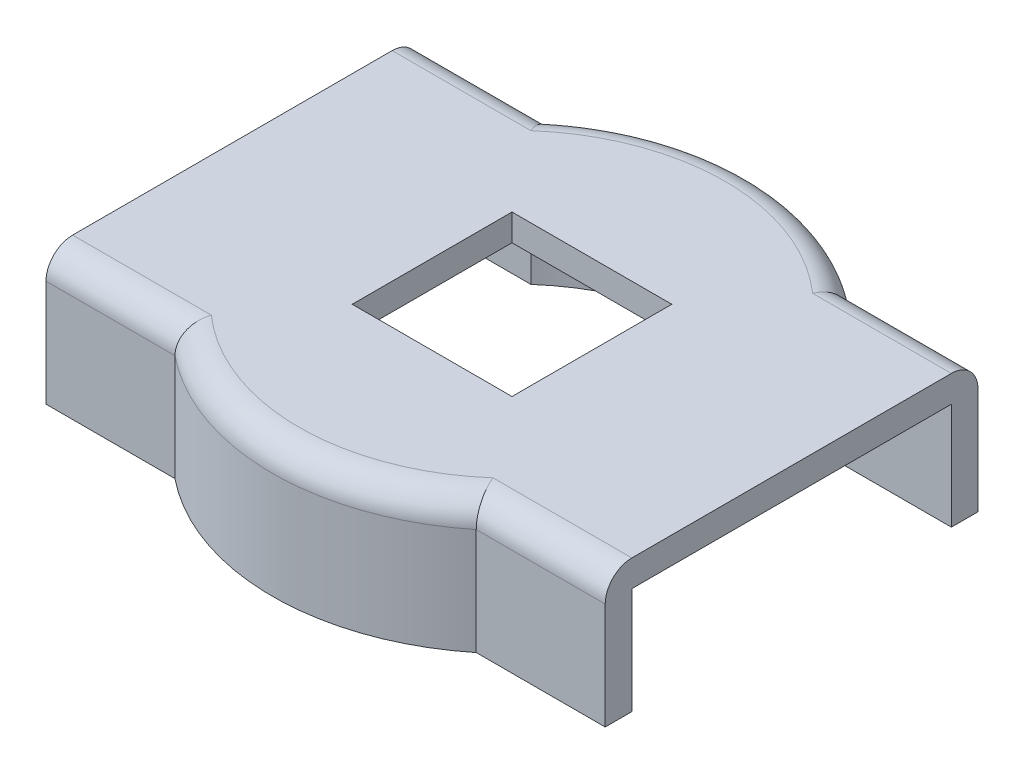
ISO-10303-21;
HEADER;
FILE_DESCRIPTION(('STEP AP214'),'2;1');
FILE_NAME('part.step','',(''),(''),'','','');
FILE_SCHEMA(('AUTOMOTIVE_DESIGN { 1 0 10303 214 1 1 1 1 }'));
ENDSEC;
DATA;
#1=APPLICATION_CONTEXT('core data for automotive mechanical design processes');
#2=APPLICATION_PROTOCOL_DEFINITION('international standard','automotive_design',2000,#1);
#3=PRODUCT_CONTEXT('',#1,'mechanical');
#4=PRODUCT('Part','Part','',(#3));
#5=PRODUCT_RELATED_PRODUCT_CATEGORY('part','',(#4));
#6=PRODUCT_DEFINITION_FORMATION('','',#4);
#7=PRODUCT_DEFINITION_CONTEXT('part definition',#1,'design');
#8=PRODUCT_DEFINITION('design','',#6,#7);
#9=PRODUCT_DEFINITION_SHAPE('','',#8);
#10=(LENGTH_UNIT() NAMED_UNIT(*) SI_UNIT(.MILLI.,.METRE.));
#11=(NAMED_UNIT(*) PLANE_ANGLE_UNIT() SI_UNIT($,.RADIAN.));
#12=(NAMED_UNIT(*) SI_UNIT($,.STERADIAN.) SOLID_ANGLE_UNIT());
#13=UNCERTAINTY_MEASURE_WITH_UNIT(LENGTH_MEASURE(1.E-05),#10,'distance_accuracy_value','');
#14=(GEOMETRIC_REPRESENTATION_CONTEXT(3) GLOBAL_UNCERTAINTY_ASSIGNED_CONTEXT((#13)) GLOBAL_UNIT_ASSIGNED_CONTEXT((#10,
#11,#12)) REPRESENTATION_CONTEXT('',''));
#15=CARTESIAN_POINT('',(0.,0.,0.));
#16=DIRECTION('',(0.,0.,1.));
#17=DIRECTION('',(1.,0.,0.));
#18=AXIS2_PLACEMENT_3D('',#15,#16,#17);
#19=CARTESIAN_POINT('',(21.,10.,14.));
#20=DIRECTION('',(-1.,0.,0.));
#21=DIRECTION('',(0.,0.,-1.));
#22=AXIS2_PLACEMENT_3D('',#19,#20,#21);
#23=PLANE('',#22);
#24=DIRECTION('',(0.,-1.,0.));
#25=VECTOR('',#24,1.);
#26=CARTESIAN_POINT('',(21.,10.,-12.));
#27=LINE('',#26,#25);
#28=CARTESIAN_POINT('',(21.,8.,-12.));
#29=VERTEX_POINT('',#28);
#30=CARTESIAN_POINT('',(21.,0.,-12.));
#31=VERTEX_POINT('',#30);
#32=EDGE_CURVE('E223',#29,#31,#27,.T.);
#33=ORIENTED_EDGE('',*,*,#32,.T.);
#34=DIRECTION('',(0.,0.,1.));
#35=VECTOR('',#34,1.);
#36=CARTESIAN_POINT('',(21.,0.,14.));
#37=LINE('',#36,#35);
#38=CARTESIAN_POINT('',(21.,0.,-14.));
#39=VERTEX_POINT('',#38);
#40=EDGE_CURVE('E303',#39,#31,#37,.T.);
#41=ORIENTED_EDGE('',*,*,#40,.F.);
#42=DIRECTION('',(0.,-1.,0.));
#43=VECTOR('',#42,1.);
#44=CARTESIAN_POINT('',(21.,10.,-14.));
#45=LINE('',#44,#43);
#46=CARTESIAN_POINT('',(21.,8.,-14.));
#47=VERTEX_POINT('',#46);
#48=EDGE_CURVE('E341',#47,#39,#45,.T.);
#49=ORIENTED_EDGE('',*,*,#48,.F.);
#50=CARTESIAN_POINT('',(21.,8.,-12.));
#51=DIRECTION('',(1.,0.,0.));
#52=DIRECTION('',(0.,0.,-1.));
#53=AXIS2_PLACEMENT_3D('',#50,#51,#52);
#54=CIRCLE('',#53,2.);
#55=CARTESIAN_POINT('',(21.,10.,-12.));
#56=VERTEX_POINT('',#55);
#57=EDGE_CURVE('E363',#56,#47,#54,.F.);
#58=ORIENTED_EDGE('',*,*,#57,.F.);
#59=DIRECTION('',(0.,0.,1.));
#60=VECTOR('',#59,1.);
#61=CARTESIAN_POINT('',(21.,10.,14.));
#62=LINE('',#61,#60);
#63=CARTESIAN_POINT('',(21.,10.,12.));
#64=VERTEX_POINT('',#63);
#65=EDGE_CURVE('E291',#56,#64,#62,.T.);
#66=ORIENTED_EDGE('',*,*,#65,.T.);
#67=CARTESIAN_POINT('',(21.,8.,12.));
#68=DIRECTION('',(1.,0.,0.));
#69=DIRECTION('',(0.,0.,-1.));
#70=AXIS2_PLACEMENT_3D('',#67,#68,#69);
#71=CIRCLE('',#70,2.);
#72=CARTESIAN_POINT('',(21.,8.,14.));
#73=VERTEX_POINT('',#72);
#74=EDGE_CURVE('E360',#73,#64,#71,.F.);
#75=ORIENTED_EDGE('',*,*,#74,.F.);
#76=DIRECTION('',(0.,-1.,0.));
#77=VECTOR('',#76,1.);
#78=CARTESIAN_POINT('',(21.,10.,14.));
#79=LINE('',#78,#77);
#80=CARTESIAN_POINT('',(21.,0.,14.));
#81=VERTEX_POINT('',#80);
#82=EDGE_CURVE('E338',#73,#81,#79,.T.);
#83=ORIENTED_EDGE('',*,*,#82,.T.);
#84=CARTESIAN_POINT('',(21.,0.,12.));
#85=VERTEX_POINT('',#84);
#86=EDGE_CURVE('E301',#85,#81,#37,.T.);
#87=ORIENTED_EDGE('',*,*,#86,.F.);
#88=DIRECTION('',(0.,-1.,0.));
#89=VECTOR('',#88,1.);
#90=CARTESIAN_POINT('',(21.,10.,12.));
#91=LINE('',#90,#89);
#92=CARTESIAN_POINT('',(21.,8.,12.));
#93=VERTEX_POINT('',#92);
#94=EDGE_CURVE('E225',#93,#85,#91,.T.);
#95=ORIENTED_EDGE('',*,*,#94,.F.);
#96=DIRECTION('',(0.,0.,1.));
#97=VECTOR('',#96,1.);
#98=CARTESIAN_POINT('',(21.,8.,14.));
#99=LINE('',#98,#97);
#100=EDGE_CURVE('E247',#29,#93,#99,.T.);
#101=ORIENTED_EDGE('',*,*,#100,.F.);
#102=EDGE_LOOP('',(#33,#41,#49,#58,#66,#75,#83,#87,#95,#101));
#103=FACE_BOUND('',#102,.T.);
#104=ADVANCED_FACE('F31',(#103),#23,.F.);
#105=CARTESIAN_POINT('',(0.,0.,0.));
#106=DIRECTION('',(0.,1.,0.));
#107=DIRECTION('',(0.,0.,1.));
#108=AXIS2_PLACEMENT_3D('',#105,#106,#107);
#109=PLANE('',#108);
#110=CARTESIAN_POINT('',(0.,0.,0.));
#111=DIRECTION('',(0.,-1.,0.));
#112=DIRECTION('',(0.,0.,1.));
#113=AXIS2_PLACEMENT_3D('',#110,#111,#112);
#114=CIRCLE('',#113,16.);
#115=CARTESIAN_POINT('',(-10.5830052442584,0.,-12.));
#116=VERTEX_POINT('',#115);
#117=CARTESIAN_POINT('',(10.5830052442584,0.,-12.));
#118=VERTEX_POINT('',#117);
#119=EDGE_CURVE('E214',#116,#118,#114,.T.);
#120=ORIENTED_EDGE('',*,*,#119,.F.);
#121=DIRECTION('',(1.,0.,0.));
#122=VECTOR('',#121,1.);
#123=CARTESIAN_POINT('',(-21.,0.,-12.));
#124=LINE('',#123,#122);
#125=CARTESIAN_POINT('',(-21.,0.,-12.));
#126=VERTEX_POINT('',#125);
#127=EDGE_CURVE('E248',#126,#116,#124,.T.);
#128=ORIENTED_EDGE('',*,*,#127,.F.);
#129=DIRECTION('',(0.,0.,-1.));
#130=VECTOR('',#129,1.);
#131=CARTESIAN_POINT('',(-21.,0.,14.));
#132=LINE('',#131,#130);
#133=CARTESIAN_POINT('',(-21.,0.,-14.));
#134=VERTEX_POINT('',#133);
#135=EDGE_CURVE('E315',#126,#134,#132,.T.);
#136=ORIENTED_EDGE('',*,*,#135,.T.);
#137=DIRECTION('',(1.,0.,0.));
#138=VECTOR('',#137,1.);
#139=CARTESIAN_POINT('',(-21.,0.,-14.));
#140=LINE('',#139,#138);
#141=CARTESIAN_POINT('',(-11.3137084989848,0.,-14.));
#142=VERTEX_POINT('',#141);
#143=EDGE_CURVE('E319',#134,#142,#140,.T.);
#144=ORIENTED_EDGE('',*,*,#143,.T.);
#145=CARTESIAN_POINT('',(0.,0.,0.));
#146=DIRECTION('',(0.,-1.,0.));
#147=DIRECTION('',(0.,0.,1.));
#148=AXIS2_PLACEMENT_3D('',#145,#146,#147);
#149=CIRCLE('',#148,18.);
#150=CARTESIAN_POINT('',(11.3137084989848,0.,-14.));
#151=VERTEX_POINT('',#150);
#152=EDGE_CURVE('E295',#142,#151,#149,.T.);
#153=ORIENTED_EDGE('',*,*,#152,.T.);
#154=DIRECTION('',(1.,0.,0.));
#155=VECTOR('',#154,1.);
#156=CARTESIAN_POINT('',(11.3137084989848,0.,-14.));
#157=LINE('',#156,#155);
#158=EDGE_CURVE('E299',#151,#39,#157,.T.);
#159=ORIENTED_EDGE('',*,*,#158,.T.);
#160=ORIENTED_EDGE('',*,*,#40,.T.);
#161=DIRECTION('',(1.,0.,0.));
#162=VECTOR('',#161,1.);
#163=CARTESIAN_POINT('',(11.3137084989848,0.,-12.));
#164=LINE('',#163,#162);
#165=EDGE_CURVE('E242',#118,#31,#164,.T.);
#166=ORIENTED_EDGE('',*,*,#165,.F.);
#167=EDGE_LOOP('',(#120,#128,#136,#144,#153,#159,#160,#166));
#168=FACE_BOUND('',#167,.T.);
#169=ADVANCED_FACE('F410',(#168),#109,.F.);
#170=CARTESIAN_POINT('',(6.,0.,-6.));
#171=DIRECTION('',(1.,0.,0.));
#172=DIRECTION('',(0.,0.,1.));
#173=AXIS2_PLACEMENT_3D('',#170,#171,#172);
#174=PLANE('',#173);
#175=DIRECTION('',(0.,0.,1.));
#176=VECTOR('',#175,1.);
#177=CARTESIAN_POINT('',(6.,8.,0.));
#178=LINE('',#177,#176);
#179=CARTESIAN_POINT('',(6.,8.,-6.));
#180=VERTEX_POINT('',#179);
#181=CARTESIAN_POINT('',(6.,8.,6.));
#182=VERTEX_POINT('',#181);
#183=EDGE_CURVE('E263',#180,#182,#178,.T.);
#184=ORIENTED_EDGE('',*,*,#183,.T.);
#185=DIRECTION('',(0.,1.,0.));
#186=VECTOR('',#185,1.);
#187=CARTESIAN_POINT('',(6.,0.,6.));
#188=LINE('',#187,#186);
#189=CARTESIAN_POINT('',(6.,10.,6.));
#190=VERTEX_POINT('',#189);
#191=EDGE_CURVE('E278',#182,#190,#188,.T.);
#192=ORIENTED_EDGE('',*,*,#191,.T.);
#193=DIRECTION('',(0.,0.,1.));
#194=VECTOR('',#193,1.);
#195=CARTESIAN_POINT('',(6.,10.,-6.));
#196=LINE('',#195,#194);
#197=CARTESIAN_POINT('',(6.,10.,-6.));
#198=VERTEX_POINT('',#197);
#199=EDGE_CURVE('E234',#198,#190,#196,.T.);
#200=ORIENTED_EDGE('',*,*,#199,.F.);
#201=DIRECTION('',(0.,1.,0.));
#202=VECTOR('',#201,1.);
#203=CARTESIAN_POINT('',(6.,0.,-6.));
#204=LINE('',#203,#202);
#205=EDGE_CURVE('E279',#180,#198,#204,.T.);
#206=ORIENTED_EDGE('',*,*,#205,.F.);
#207=EDGE_LOOP('',(#184,#192,#200,#206));
#208=FACE_BOUND('',#207,.T.);
#209=ADVANCED_FACE('F444',(#208),#174,.F.);
#210=CARTESIAN_POINT('',(6.,0.,-6.));
#211=DIRECTION('',(0.,0.,-1.));
#212=DIRECTION('',(1.,0.,0.));
#213=AXIS2_PLACEMENT_3D('',#210,#211,#212);
#214=PLANE('',#213);
#215=DIRECTION('',(1.,0.,0.));
#216=VECTOR('',#215,1.);
#217=CARTESIAN_POINT('',(0.,8.,-6.));
#218=LINE('',#217,#216);
#219=CARTESIAN_POINT('',(-6.,8.,-6.));
#220=VERTEX_POINT('',#219);
#221=EDGE_CURVE('E245',#220,#180,#218,.T.);
#222=ORIENTED_EDGE('',*,*,#221,.T.);
#223=ORIENTED_EDGE('',*,*,#205,.T.);
#224=DIRECTION('',(1.,0.,0.));
#225=VECTOR('',#224,1.);
#226=CARTESIAN_POINT('',(6.,10.,-6.));
#227=LINE('',#226,#225);
#228=CARTESIAN_POINT('',(-6.,10.,-6.));
#229=VERTEX_POINT('',#228);
#230=EDGE_CURVE('E276',#229,#198,#227,.T.);
#231=ORIENTED_EDGE('',*,*,#230,.F.);
#232=DIRECTION('',(0.,1.,0.));
#233=VECTOR('',#232,1.);
#234=CARTESIAN_POINT('',(-6.,0.,-6.));
#235=LINE('',#234,#233);
#236=EDGE_CURVE('E283',#220,#229,#235,.T.);
#237=ORIENTED_EDGE('',*,*,#236,.F.);
#238=EDGE_LOOP('',(#222,#223,#231,#237));
#239=FACE_BOUND('',#238,.T.);
#240=ADVANCED_FACE('F447',(#239),#214,.F.);
#241=CARTESIAN_POINT('',(-6.,0.,-6.));
#242=DIRECTION('',(-1.,0.,0.));
#243=DIRECTION('',(0.,0.,-1.));
#244=AXIS2_PLACEMENT_3D('',#241,#242,#243);
#245=PLANE('',#244);
#246=DIRECTION('',(0.,0.,-1.));
#247=VECTOR('',#246,1.);
#248=CARTESIAN_POINT('',(-6.,8.,0.));
#249=LINE('',#248,#247);
#250=CARTESIAN_POINT('',(-6.,8.,6.));
#251=VERTEX_POINT('',#250);
#252=EDGE_CURVE('E267',#251,#220,#249,.T.);
#253=ORIENTED_EDGE('',*,*,#252,.T.);
#254=ORIENTED_EDGE('',*,*,#236,.T.);
#255=DIRECTION('',(0.,0.,-1.));
#256=VECTOR('',#255,1.);
#257=CARTESIAN_POINT('',(-6.,10.,-6.));
#258=LINE('',#257,#256);
#259=CARTESIAN_POINT('',(-6.,10.,6.));
#260=VERTEX_POINT('',#259);
#261=EDGE_CURVE('E274',#260,#229,#258,.T.);
#262=ORIENTED_EDGE('',*,*,#261,.F.);
#263=DIRECTION('',(0.,1.,0.));
#264=VECTOR('',#263,1.);
#265=CARTESIAN_POINT('',(-6.,0.,6.));
#266=LINE('',#265,#264);
#267=EDGE_CURVE('E286',#251,#260,#266,.T.);
#268=ORIENTED_EDGE('',*,*,#267,.F.);
#269=EDGE_LOOP('',(#253,#254,#262,#268));
#270=FACE_BOUND('',#269,.T.);
#271=ADVANCED_FACE('F451',(#270),#245,.F.);
#272=CARTESIAN_POINT('',(6.,0.,6.));
#273=DIRECTION('',(0.,0.,1.));
#274=DIRECTION('',(-1.,0.,0.));
#275=AXIS2_PLACEMENT_3D('',#272,#273,#274);
#276=PLANE('',#275);
#277=DIRECTION('',(-1.,0.,0.));
#278=VECTOR('',#277,1.);
#279=CARTESIAN_POINT('',(0.,8.,6.));
#280=LINE('',#279,#278);
#281=EDGE_CURVE('E60',#182,#251,#280,.T.);
#282=ORIENTED_EDGE('',*,*,#281,.T.);
#283=ORIENTED_EDGE('',*,*,#267,.T.);
#284=DIRECTION('',(-1.,0.,0.));
#285=VECTOR('',#284,1.);
#286=CARTESIAN_POINT('',(6.,10.,6.));
#287=LINE('',#286,#285);
#288=EDGE_CURVE('E272',#190,#260,#287,.T.);
#289=ORIENTED_EDGE('',*,*,#288,.F.);
#290=ORIENTED_EDGE('',*,*,#191,.F.);
#291=EDGE_LOOP('',(#282,#283,#289,#290));
#292=FACE_BOUND('',#291,.T.);
#293=ADVANCED_FACE('F406',(#292),#276,.F.);
#294=CARTESIAN_POINT('',(11.3137084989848,10.,-14.));
#295=DIRECTION('',(0.,0.,1.));
#296=DIRECTION('',(-1.,0.,0.));
#297=AXIS2_PLACEMENT_3D('',#294,#295,#296);
#298=PLANE('',#297);
#299=ORIENTED_EDGE('',*,*,#48,.T.);
#300=ORIENTED_EDGE('',*,*,#158,.F.);
#301=DIRECTION('',(0.,-1.,0.));
#302=VECTOR('',#301,1.);
#303=CARTESIAN_POINT('',(11.3137084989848,10.,-14.));
#304=LINE('',#303,#302);
#305=CARTESIAN_POINT('',(11.3137084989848,8.,-14.));
#306=VERTEX_POINT('',#305);
#307=EDGE_CURVE('E298',#306,#151,#304,.T.);
#308=ORIENTED_EDGE('',*,*,#307,.F.);
#309=DIRECTION('',(1.,0.,0.));
#310=VECTOR('',#309,1.);
#311=CARTESIAN_POINT('',(11.3137084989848,8.,-14.));
#312=LINE('',#311,#310);
#313=EDGE_CURVE('E366',#47,#306,#312,.F.);
#314=ORIENTED_EDGE('',*,*,#313,.F.);
#315=EDGE_LOOP('',(#299,#300,#308,#314));
#316=FACE_BOUND('',#315,.T.);
#317=ADVANCED_FACE('F402',(#316),#298,.F.);
#318=CARTESIAN_POINT('',(11.3137084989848,10.,14.));
#319=DIRECTION('',(0.,0.,-1.));
#320=DIRECTION('',(1.,0.,0.));
#321=AXIS2_PLACEMENT_3D('',#318,#319,#320);
#322=PLANE('',#321);
#323=DIRECTION('',(0.,-1.,0.));
#324=VECTOR('',#323,1.);
#325=CARTESIAN_POINT('',(11.3137084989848,10.,14.));
#326=LINE('',#325,#324);
#327=CARTESIAN_POINT('',(11.3137084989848,8.,14.));
#328=VERTEX_POINT('',#327);
#329=CARTESIAN_POINT('',(11.3137084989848,0.,14.));
#330=VERTEX_POINT('',#329);
#331=EDGE_CURVE('E335',#328,#330,#326,.T.);
#332=ORIENTED_EDGE('',*,*,#331,.T.);
#333=DIRECTION('',(-1.,0.,0.));
#334=VECTOR('',#333,1.);
#335=CARTESIAN_POINT('',(11.3137084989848,0.,14.));
#336=LINE('',#335,#334);
#337=EDGE_CURVE('E306',#81,#330,#336,.T.);
#338=ORIENTED_EDGE('',*,*,#337,.F.);
#339=ORIENTED_EDGE('',*,*,#82,.F.);
#340=DIRECTION('',(-1.,0.,0.));
#341=VECTOR('',#340,1.);
#342=CARTESIAN_POINT('',(21.,8.,14.));
#343=LINE('',#342,#341);
#344=EDGE_CURVE('E11',#328,#73,#343,.F.);
#345=ORIENTED_EDGE('',*,*,#344,.F.);
#346=EDGE_LOOP('',(#332,#338,#339,#345));
#347=FACE_BOUND('',#346,.T.);
#348=ADVANCED_FACE('F405',(#347),#322,.F.);
#349=CARTESIAN_POINT('',(0.,10.,0.));
#350=DIRECTION('',(0.,-1.,0.));
#351=DIRECTION('',(0.,0.,-1.));
#352=AXIS2_PLACEMENT_3D('',#349,#350,#351);
#353=CYLINDRICAL_SURFACE('',#352,18.);
#354=DIRECTION('',(0.,-1.,0.));
#355=VECTOR('',#354,1.);
#356=CARTESIAN_POINT('',(-11.3137084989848,10.,14.));
#357=LINE('',#356,#355);
#358=CARTESIAN_POINT('',(-11.3137084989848,8.,14.));
#359=VERTEX_POINT('',#358);
#360=CARTESIAN_POINT('',(-11.3137084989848,0.,14.));
#361=VERTEX_POINT('',#360);
#362=EDGE_CURVE('E332',#359,#361,#357,.T.);
#363=ORIENTED_EDGE('',*,*,#362,.T.);
#364=CARTESIAN_POINT('',(0.,0.,0.));
#365=DIRECTION('',(0.,-1.,0.));
#366=DIRECTION('',(0.,0.,1.));
#367=AXIS2_PLACEMENT_3D('',#364,#365,#366);
#368=CIRCLE('',#367,18.);
#369=EDGE_CURVE('E309',#330,#361,#368,.T.);
#370=ORIENTED_EDGE('',*,*,#369,.F.);
#371=ORIENTED_EDGE('',*,*,#331,.F.);
#372=CARTESIAN_POINT('',(0.,8.,0.));
#373=DIRECTION('',(0.,-1.,0.));
#374=DIRECTION('',(0.,0.,1.));
#375=AXIS2_PLACEMENT_3D('',#372,#373,#374);
#376=CIRCLE('',#375,18.);
#377=EDGE_CURVE('E44',#359,#328,#376,.F.);
#378=ORIENTED_EDGE('',*,*,#377,.F.);
#379=EDGE_LOOP('',(#363,#370,#371,#378));
#380=FACE_BOUND('',#379,.T.);
#381=ADVANCED_FACE('F414',(#380),#353,.T.);
#382=CARTESIAN_POINT('',(-21.,10.,14.));
#383=DIRECTION('',(0.,0.,-1.));
#384=DIRECTION('',(1.,0.,0.));
#385=AXIS2_PLACEMENT_3D('',#382,#383,#384);
#386=PLANE('',#385);
#387=DIRECTION('',(0.,-1.,0.));
#388=VECTOR('',#387,1.);
#389=CARTESIAN_POINT('',(-21.,10.,14.));
#390=LINE('',#389,#388);
#391=CARTESIAN_POINT('',(-21.,8.,14.));
#392=VERTEX_POINT('',#391);
#393=CARTESIAN_POINT('',(-21.,0.,14.));
#394=VERTEX_POINT('',#393);
#395=EDGE_CURVE('E329',#392,#394,#390,.T.);
#396=ORIENTED_EDGE('',*,*,#395,.T.);
#397=DIRECTION('',(-1.,0.,0.));
#398=VECTOR('',#397,1.);
#399=CARTESIAN_POINT('',(-21.,0.,14.));
#400=LINE('',#399,#398);
#401=EDGE_CURVE('E312',#361,#394,#400,.T.);
#402=ORIENTED_EDGE('',*,*,#401,.F.);
#403=ORIENTED_EDGE('',*,*,#362,.F.);
#404=DIRECTION('',(-1.,0.,0.));
#405=VECTOR('',#404,1.);
#406=CARTESIAN_POINT('',(-11.3137084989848,8.,14.));
#407=LINE('',#406,#405);
#408=EDGE_CURVE('E379',#392,#359,#407,.F.);
#409=ORIENTED_EDGE('',*,*,#408,.F.);
#410=EDGE_LOOP('',(#396,#402,#403,#409));
#411=FACE_BOUND('',#410,.T.);
#412=ADVANCED_FACE('F418',(#411),#386,.F.);
#413=CARTESIAN_POINT('',(-21.,10.,14.));
#414=DIRECTION('',(1.,0.,0.));
#415=DIRECTION('',(0.,0.,1.));
#416=AXIS2_PLACEMENT_3D('',#413,#414,#415);
#417=PLANE('',#416);
#418=DIRECTION('',(0.,0.,-1.));
#419=VECTOR('',#418,1.);
#420=CARTESIAN_POINT('',(-21.,8.,14.));
#421=LINE('',#420,#419);
#422=CARTESIAN_POINT('',(-21.,8.,12.));
#423=VERTEX_POINT('',#422);
#424=CARTESIAN_POINT('',(-21.,8.,-12.));
#425=VERTEX_POINT('',#424);
#426=EDGE_CURVE('E218',#423,#425,#421,.T.);
#427=ORIENTED_EDGE('',*,*,#426,.F.);
#428=DIRECTION('',(0.,-1.,0.));
#429=VECTOR('',#428,1.);
#430=CARTESIAN_POINT('',(-21.,10.,12.));
#431=LINE('',#430,#429);
#432=CARTESIAN_POINT('',(-21.,0.,12.));
#433=VERTEX_POINT('',#432);
#434=EDGE_CURVE('E240',#423,#433,#431,.T.);
#435=ORIENTED_EDGE('',*,*,#434,.T.);
#436=EDGE_CURVE('E316',#394,#433,#132,.T.);
#437=ORIENTED_EDGE('',*,*,#436,.F.);
#438=ORIENTED_EDGE('',*,*,#395,.F.);
#439=CARTESIAN_POINT('',(-21.,8.,12.));
#440=DIRECTION('',(-1.,0.,0.));
#441=DIRECTION('',(0.,0.,1.));
#442=AXIS2_PLACEMENT_3D('',#439,#440,#441);
#443=CIRCLE('',#442,2.);
#444=CARTESIAN_POINT('',(-21.,10.,12.));
#445=VERTEX_POINT('',#444);
#446=EDGE_CURVE('E374',#445,#392,#443,.F.);
#447=ORIENTED_EDGE('',*,*,#446,.F.);
#448=DIRECTION('',(0.,0.,-1.));
#449=VECTOR('',#448,1.);
#450=CARTESIAN_POINT('',(-21.,10.,14.));
#451=LINE('',#450,#449);
#452=CARTESIAN_POINT('',(-21.,10.,-12.));
#453=VERTEX_POINT('',#452);
#454=EDGE_CURVE('E294',#445,#453,#451,.T.);
#455=ORIENTED_EDGE('',*,*,#454,.T.);
#456=CARTESIAN_POINT('',(-21.,8.,-12.));
#457=DIRECTION('',(-1.,0.,0.));
#458=DIRECTION('',(0.,0.,1.));
#459=AXIS2_PLACEMENT_3D('',#456,#457,#458);
#460=CIRCLE('',#459,2.);
#461=CARTESIAN_POINT('',(-21.,8.,-14.));
#462=VERTEX_POINT('',#461);
#463=EDGE_CURVE('E376',#462,#453,#460,.F.);
#464=ORIENTED_EDGE('',*,*,#463,.F.);
#465=DIRECTION('',(0.,-1.,0.));
#466=VECTOR('',#465,1.);
#467=CARTESIAN_POINT('',(-21.,10.,-14.));
#468=LINE('',#467,#466);
#469=EDGE_CURVE('E327',#462,#134,#468,.T.);
#470=ORIENTED_EDGE('',*,*,#469,.T.);
#471=ORIENTED_EDGE('',*,*,#135,.F.);
#472=DIRECTION('',(0.,-1.,0.));
#473=VECTOR('',#472,1.);
#474=CARTESIAN_POINT('',(-21.,10.,-12.));
#475=LINE('',#474,#473);
#476=EDGE_CURVE('E229',#425,#126,#475,.T.);
#477=ORIENTED_EDGE('',*,*,#476,.F.);
#478=EDGE_LOOP('',(#427,#435,#437,#438,#447,#455,#464,#470,#471,#477));
#479=FACE_BOUND('',#478,.T.);
#480=ADVANCED_FACE('F422',(#479),#417,.F.);
#481=CARTESIAN_POINT('',(-21.,10.,-14.));
#482=DIRECTION('',(0.,0.,1.));
#483=DIRECTION('',(-1.,0.,0.));
#484=AXIS2_PLACEMENT_3D('',#481,#482,#483);
#485=PLANE('',#484);
#486=DIRECTION('',(0.,-1.,0.));
#487=VECTOR('',#486,1.);
#488=CARTESIAN_POINT('',(-11.3137084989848,10.,-14.));
#489=LINE('',#488,#487);
#490=CARTESIAN_POINT('',(-11.3137084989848,8.,-14.));
#491=VERTEX_POINT('',#490);
#492=EDGE_CURVE('E325',#491,#142,#489,.T.);
#493=ORIENTED_EDGE('',*,*,#492,.T.);
#494=ORIENTED_EDGE('',*,*,#143,.F.);
#495=ORIENTED_EDGE('',*,*,#469,.F.);
#496=DIRECTION('',(1.,0.,0.));
#497=VECTOR('',#496,1.);
#498=CARTESIAN_POINT('',(-21.,8.,-14.));
#499=LINE('',#498,#497);
#500=EDGE_CURVE('E372',#491,#462,#499,.F.);
#501=ORIENTED_EDGE('',*,*,#500,.F.);
#502=EDGE_LOOP('',(#493,#494,#495,#501));
#503=FACE_BOUND('',#502,.T.);
#504=ADVANCED_FACE('F426',(#503),#485,.F.);
#505=CARTESIAN_POINT('',(0.,10.,0.));
#506=DIRECTION('',(0.,-1.,0.));
#507=DIRECTION('',(0.,0.,-1.));
#508=AXIS2_PLACEMENT_3D('',#505,#506,#507);
#509=CYLINDRICAL_SURFACE('',#508,18.);
#510=ORIENTED_EDGE('',*,*,#307,.T.);
#511=ORIENTED_EDGE('',*,*,#152,.F.);
#512=ORIENTED_EDGE('',*,*,#492,.F.);
#513=CARTESIAN_POINT('',(0.,8.,0.));
#514=DIRECTION('',(0.,-1.,0.));
#515=DIRECTION('',(0.,0.,1.));
#516=AXIS2_PLACEMENT_3D('',#513,#514,#515);
#517=CIRCLE('',#516,18.);
#518=EDGE_CURVE('E369',#306,#491,#517,.F.);
#519=ORIENTED_EDGE('',*,*,#518,.F.);
#520=EDGE_LOOP('',(#510,#511,#512,#519));
#521=FACE_BOUND('',#520,.T.);
#522=ADVANCED_FACE('F430',(#521),#509,.T.);
#523=CARTESIAN_POINT('',(0.,10.,0.));
#524=DIRECTION('',(0.,1.,0.));
#525=DIRECTION('',(0.,0.,1.));
#526=AXIS2_PLACEMENT_3D('',#523,#524,#525);
#527=PLANE('',#526);
#528=ORIENTED_EDGE('',*,*,#199,.T.);
#529=ORIENTED_EDGE('',*,*,#288,.T.);
#530=ORIENTED_EDGE('',*,*,#261,.T.);
#531=ORIENTED_EDGE('',*,*,#230,.T.);
#532=EDGE_LOOP('',(#528,#529,#530,#531));
#533=FACE_BOUND('',#532,.T.);
#534=CARTESIAN_POINT('',(0.,10.,0.));
#535=DIRECTION('',(0.,-1.,0.));
#536=DIRECTION('',(0.,0.,1.));
#537=AXIS2_PLACEMENT_3D('',#534,#535,#536);
#538=CIRCLE('',#537,16.);
#539=CARTESIAN_POINT('',(-10.5830052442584,10.,-12.));
#540=VERTEX_POINT('',#539);
#541=CARTESIAN_POINT('',(10.5830052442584,10.,-12.));
#542=VERTEX_POINT('',#541);
#543=EDGE_CURVE('E355',#540,#542,#538,.T.);
#544=ORIENTED_EDGE('',*,*,#543,.F.);
#545=DIRECTION('',(1.,0.,0.));
#546=VECTOR('',#545,1.);
#547=CARTESIAN_POINT('',(-11.3137084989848,10.,-12.));
#548=LINE('',#547,#546);
#549=EDGE_CURVE('E352',#453,#540,#548,.T.);
#550=ORIENTED_EDGE('',*,*,#549,.F.);
#551=ORIENTED_EDGE('',*,*,#454,.F.);
#552=DIRECTION('',(-1.,0.,0.));
#553=VECTOR('',#552,1.);
#554=CARTESIAN_POINT('',(-21.,10.,12.));
#555=LINE('',#554,#553);
#556=CARTESIAN_POINT('',(-10.5830052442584,10.,12.));
#557=VERTEX_POINT('',#556);
#558=EDGE_CURVE('E350',#557,#445,#555,.T.);
#559=ORIENTED_EDGE('',*,*,#558,.F.);
#560=CARTESIAN_POINT('',(0.,10.,0.));
#561=DIRECTION('',(0.,-1.,0.));
#562=DIRECTION('',(0.,0.,1.));
#563=AXIS2_PLACEMENT_3D('',#560,#561,#562);
#564=CIRCLE('',#563,16.);
#565=CARTESIAN_POINT('',(10.5830052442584,10.,12.));
#566=VERTEX_POINT('',#565);
#567=EDGE_CURVE('E347',#566,#557,#564,.T.);
#568=ORIENTED_EDGE('',*,*,#567,.F.);
#569=DIRECTION('',(-1.,0.,0.));
#570=VECTOR('',#569,1.);
#571=CARTESIAN_POINT('',(11.3137084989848,10.,12.));
#572=LINE('',#571,#570);
#573=EDGE_CURVE('E344',#64,#566,#572,.T.);
#574=ORIENTED_EDGE('',*,*,#573,.F.);
#575=ORIENTED_EDGE('',*,*,#65,.F.);
#576=DIRECTION('',(1.,0.,0.));
#577=VECTOR('',#576,1.);
#578=CARTESIAN_POINT('',(21.,10.,-12.));
#579=LINE('',#578,#577);
#580=EDGE_CURVE('E358',#542,#56,#579,.T.);
#581=ORIENTED_EDGE('',*,*,#580,.F.);
#582=EDGE_LOOP('',(#544,#550,#551,#559,#568,#574,#575,#581));
#583=FACE_BOUND('',#582,.T.);
#584=ADVANCED_FACE('F434',(#533,#583),#527,.T.);
#585=CARTESIAN_POINT('',(0.,0.,0.));
#586=DIRECTION('',(0.,-1.,0.));
#587=DIRECTION('',(0.,0.,1.));
#588=AXIS2_PLACEMENT_3D('',#585,#586,#587);
#589=CIRCLE('',#588,16.);
#590=CARTESIAN_POINT('',(10.5830052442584,0.,12.));
#591=VERTEX_POINT('',#590);
#592=CARTESIAN_POINT('',(-10.5830052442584,0.,12.));
#593=VERTEX_POINT('',#592);
#594=EDGE_CURVE('E257',#591,#593,#589,.T.);
#595=ORIENTED_EDGE('',*,*,#594,.F.);
#596=DIRECTION('',(-1.,0.,0.));
#597=VECTOR('',#596,1.);
#598=CARTESIAN_POINT('',(11.3137084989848,0.,12.));
#599=LINE('',#598,#597);
#600=EDGE_CURVE('E244',#85,#591,#599,.T.);
#601=ORIENTED_EDGE('',*,*,#600,.F.);
#602=ORIENTED_EDGE('',*,*,#86,.T.);
#603=ORIENTED_EDGE('',*,*,#337,.T.);
#604=ORIENTED_EDGE('',*,*,#369,.T.);
#605=ORIENTED_EDGE('',*,*,#401,.T.);
#606=ORIENTED_EDGE('',*,*,#436,.T.);
#607=DIRECTION('',(-1.,0.,0.));
#608=VECTOR('',#607,1.);
#609=CARTESIAN_POINT('',(-21.,0.,12.));
#610=LINE('',#609,#608);
#611=EDGE_CURVE('E251',#593,#433,#610,.T.);
#612=ORIENTED_EDGE('',*,*,#611,.F.);
#613=EDGE_LOOP('',(#595,#601,#602,#603,#604,#605,#606,#612));
#614=FACE_BOUND('',#613,.T.);
#615=ADVANCED_FACE('F436',(#614),#109,.F.);
#616=CARTESIAN_POINT('',(0.,8.,-12.));
#617=DIRECTION('',(-1.,0.,0.));
#618=DIRECTION('',(0.,0.,-1.));
#619=AXIS2_PLACEMENT_3D('',#616,#617,#618);
#620=CYLINDRICAL_SURFACE('',#619,2.);
#621=ORIENTED_EDGE('',*,*,#463,.T.);
#622=ORIENTED_EDGE('',*,*,#549,.T.);
#623=CARTESIAN_POINT('',(-11.3137084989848,8.,-14.));
#624=CARTESIAN_POINT('',(-11.3137106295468,8.05388922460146,-14.0000069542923));
#625=CARTESIAN_POINT('',(-11.3129384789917,8.10777495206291,-13.9978220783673));
#626=CARTESIAN_POINT('',(-11.3098621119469,8.21514339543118,-13.9891220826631));
#627=CARTESIAN_POINT('',(-11.3075581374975,8.2686261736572,-13.9826076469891));
#628=CARTESIAN_POINT('',(-11.3014413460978,8.37469315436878,-13.9653209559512));
#629=CARTESIAN_POINT('',(-11.2976318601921,8.42727907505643,-13.9545581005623));
#630=CARTESIAN_POINT('',(-11.2885396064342,8.53128468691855,-13.9288882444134));
#631=CARTESIAN_POINT('',(-11.2832568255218,8.58270436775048,-13.9139812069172));
#632=CARTESIAN_POINT('',(-11.2652568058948,8.73466856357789,-13.8632330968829));
#633=CARTESIAN_POINT('',(-11.2503819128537,8.83302091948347,-13.8213480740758));
#634=CARTESIAN_POINT('',(-11.2153610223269,9.02105044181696,-13.7230022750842));
#635=CARTESIAN_POINT('',(-11.1952139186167,9.11072578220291,-13.666538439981));
#636=CARTESIAN_POINT('',(-11.1497106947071,9.2812833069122,-13.5394400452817));
#637=CARTESIAN_POINT('',(-11.1242452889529,9.36191539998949,-13.4685090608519));
#638=CARTESIAN_POINT('',(-11.0691135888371,9.51018034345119,-13.3155645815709));
#639=CARTESIAN_POINT('',(-11.039445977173,9.57780910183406,-13.2335476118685));
#640=CARTESIAN_POINT('',(-10.9749608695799,9.7020719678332,-13.0560840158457));
#641=CARTESIAN_POINT('',(-10.9399511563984,9.75790915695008,-12.960149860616));
#642=CARTESIAN_POINT('',(-10.8670026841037,9.85271436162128,-12.7613023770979));
#643=CARTESIAN_POINT('',(-10.8290634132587,9.89167942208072,-12.658387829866));
#644=CARTESIAN_POINT('',(-10.7572845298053,9.9474380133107,-12.4647610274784));
#645=CARTESIAN_POINT('',(-10.7237291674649,9.96674270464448,-12.3746510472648));
#646=CARTESIAN_POINT('',(-10.6557854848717,9.99276295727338,-12.1930768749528));
#647=CARTESIAN_POINT('',(-10.6213989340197,9.99950322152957,-12.1016156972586));
#648=CARTESIAN_POINT('',(-10.5855971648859,9.99999120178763,-12.0068582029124));
#649=CARTESIAN_POINT('',(-10.5843012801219,10.0000000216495,-12.0034289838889));
#650=CARTESIAN_POINT('',(-10.5830052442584,10.,-12.));
#651=B_SPLINE_CURVE_WITH_KNOTS('',3,(#623,#624,#625,#626,#627,#628,#629,#630,#631,#632,#633,
#634,#635,#636,#637,#638,#639,#640,#641,#642,#643,#644,#645,#646,#647,#648,#649,#650),
.UNSPECIFIED.,.F.,.F.,(4,2,2,2,2,2,2,2,2,2,2,2,2,4),(0.,0.161611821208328,0.323198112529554,
0.484428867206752,0.645661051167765,0.967816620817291,1.29003983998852,1.61968442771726,
1.94943258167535,2.29709516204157,2.644818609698,2.9382744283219,3.23115267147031,
3.242150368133),.UNSPECIFIED.);
#652=EDGE_CURVE('E302',#540,#491,#651,.F.);
#653=ORIENTED_EDGE('',*,*,#652,.T.);
#654=ORIENTED_EDGE('',*,*,#500,.T.);
#655=EDGE_LOOP('',(#621,#622,#653,#654));
#656=FACE_BOUND('',#655,.T.);
#657=ADVANCED_FACE('F439',(#656),#620,.T.);
#658=CARTESIAN_POINT('',(0.,8.,0.));
#659=DIRECTION('',(0.,1.,0.));
#660=DIRECTION('',(0.,0.,1.));
#661=AXIS2_PLACEMENT_3D('',#658,#659,#660);
#662=TOROIDAL_SURFACE('',#661,16.,2.);
#663=ORIENTED_EDGE('',*,*,#652,.F.);
#664=ORIENTED_EDGE('',*,*,#543,.T.);
#665=CARTESIAN_POINT('',(11.3137084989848,8.,-14.));
#666=CARTESIAN_POINT('',(11.3137106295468,8.05388922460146,-14.0000069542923));
#667=CARTESIAN_POINT('',(11.3129384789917,8.10777495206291,-13.9978220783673));
#668=CARTESIAN_POINT('',(11.3098621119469,8.21514339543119,-13.9891220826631));
#669=CARTESIAN_POINT('',(11.3075581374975,8.2686261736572,-13.9826076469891));
#670=CARTESIAN_POINT('',(11.3014413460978,8.37469315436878,-13.9653209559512));
#671=CARTESIAN_POINT('',(11.2976318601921,8.42727907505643,-13.9545581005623));
#672=CARTESIAN_POINT('',(11.2885396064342,8.53128468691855,-13.9288882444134));
#673=CARTESIAN_POINT('',(11.2832568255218,8.58270436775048,-13.9139812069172));
#674=CARTESIAN_POINT('',(11.2652568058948,8.73466856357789,-13.8632330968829));
#675=CARTESIAN_POINT('',(11.2503819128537,8.83302091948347,-13.8213480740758));
#676=CARTESIAN_POINT('',(11.2153610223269,9.02105044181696,-13.7230022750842));
#677=CARTESIAN_POINT('',(11.1952139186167,9.11072578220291,-13.666538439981));
#678=CARTESIAN_POINT('',(11.1497106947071,9.2812833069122,-13.5394400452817));
#679=CARTESIAN_POINT('',(11.1242452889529,9.36191539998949,-13.4685090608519));
#680=CARTESIAN_POINT('',(11.0691135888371,9.51018034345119,-13.3155645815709));
#681=CARTESIAN_POINT('',(11.039445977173,9.57780910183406,-13.2335476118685));
#682=CARTESIAN_POINT('',(10.9749608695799,9.7020719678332,-13.0560840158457));
#683=CARTESIAN_POINT('',(10.9399511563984,9.75790915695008,-12.960149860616));
#684=CARTESIAN_POINT('',(10.8670026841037,9.85271436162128,-12.7613023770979));
#685=CARTESIAN_POINT('',(10.8290634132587,9.89167942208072,-12.658387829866));
#686=CARTESIAN_POINT('',(10.7572845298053,9.9474380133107,-12.4647610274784));
#687=CARTESIAN_POINT('',(10.7237291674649,9.96674270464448,-12.3746510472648));
#688=CARTESIAN_POINT('',(10.6557854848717,9.99276295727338,-12.1930768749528));
#689=CARTESIAN_POINT('',(10.6213989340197,9.99950322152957,-12.1016156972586));
#690=CARTESIAN_POINT('',(10.5855971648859,9.99999120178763,-12.0068582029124));
#691=CARTESIAN_POINT('',(10.5843012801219,10.0000000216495,-12.0034289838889));
#692=CARTESIAN_POINT('',(10.5830052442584,10.,-12.));
#693=B_SPLINE_CURVE_WITH_KNOTS('',3,(#665,#666,#667,#668,#669,#670,#671,#672,#673,#674,#675,
#676,#677,#678,#679,#680,#681,#682,#683,#684,#685,#686,#687,#688,#689,#690,#691,#692),
.UNSPECIFIED.,.F.,.F.,(4,2,2,2,2,2,2,2,2,2,2,2,2,4),(0.,0.161611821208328,0.323198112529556,
0.484428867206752,0.645661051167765,0.967816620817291,1.29003983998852,1.61968442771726,
1.94943258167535,2.29709516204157,2.644818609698,2.9382744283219,3.23115267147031,
3.242150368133),.UNSPECIFIED.);
#694=EDGE_CURVE('E384',#542,#306,#693,.F.);
#695=ORIENTED_EDGE('',*,*,#694,.T.);
#696=ORIENTED_EDGE('',*,*,#518,.T.);
#697=EDGE_LOOP('',(#663,#664,#695,#696));
#698=FACE_BOUND('',#697,.T.);
#699=ADVANCED_FACE('F395',(#698),#662,.T.);
#700=CARTESIAN_POINT('',(0.,8.,-12.));
#701=DIRECTION('',(-1.,0.,0.));
#702=DIRECTION('',(0.,0.,-1.));
#703=AXIS2_PLACEMENT_3D('',#700,#701,#702);
#704=CYLINDRICAL_SURFACE('',#703,2.);
#705=ORIENTED_EDGE('',*,*,#694,.F.);
#706=ORIENTED_EDGE('',*,*,#580,.T.);
#707=ORIENTED_EDGE('',*,*,#57,.T.);
#708=ORIENTED_EDGE('',*,*,#313,.T.);
#709=EDGE_LOOP('',(#705,#706,#707,#708));
#710=FACE_BOUND('',#709,.T.);
#711=ADVANCED_FACE('F397',(#710),#704,.T.);
#712=CARTESIAN_POINT('',(0.,8.,12.));
#713=DIRECTION('',(1.,0.,0.));
#714=DIRECTION('',(0.,0.,1.));
#715=AXIS2_PLACEMENT_3D('',#712,#713,#714);
#716=CYLINDRICAL_SURFACE('',#715,2.);
#717=ORIENTED_EDGE('',*,*,#74,.T.);
#718=ORIENTED_EDGE('',*,*,#573,.T.);
#719=CARTESIAN_POINT('',(11.3137084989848,8.,14.));
#720=CARTESIAN_POINT('',(11.3137106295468,8.05388922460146,14.0000069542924));
#721=CARTESIAN_POINT('',(11.3129384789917,8.10777495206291,13.9978220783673));
#722=CARTESIAN_POINT('',(11.3098621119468,8.21514339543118,13.9891220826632));
#723=CARTESIAN_POINT('',(11.3075581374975,8.2686261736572,13.9826076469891));
#724=CARTESIAN_POINT('',(11.3014413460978,8.37469315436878,13.9653209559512));
#725=CARTESIAN_POINT('',(11.2976318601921,8.42727907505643,13.9545581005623));
#726=CARTESIAN_POINT('',(11.2885396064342,8.53128468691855,13.9288882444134));
#727=CARTESIAN_POINT('',(11.2832568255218,8.58270436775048,13.9139812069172));
#728=CARTESIAN_POINT('',(11.2652568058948,8.73466856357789,13.8632330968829));
#729=CARTESIAN_POINT('',(11.2503819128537,8.83302091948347,13.8213480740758));
#730=CARTESIAN_POINT('',(11.2153610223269,9.02105044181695,13.7230022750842));
#731=CARTESIAN_POINT('',(11.1952139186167,9.1107257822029,13.666538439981));
#732=CARTESIAN_POINT('',(11.1497106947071,9.28128330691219,13.5394400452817));
#733=CARTESIAN_POINT('',(11.1242452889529,9.36191539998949,13.4685090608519));
#734=CARTESIAN_POINT('',(11.0691135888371,9.51018034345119,13.3155645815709));
#735=CARTESIAN_POINT('',(11.039445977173,9.57780910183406,13.2335476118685));
#736=CARTESIAN_POINT('',(10.9749608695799,9.7020719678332,13.0560840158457));
#737=CARTESIAN_POINT('',(10.9399511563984,9.75790915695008,12.960149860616));
#738=CARTESIAN_POINT('',(10.8670026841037,9.85271436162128,12.7613023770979));
#739=CARTESIAN_POINT('',(10.8290634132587,9.89167942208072,12.6583878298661));
#740=CARTESIAN_POINT('',(10.7572845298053,9.9474380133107,12.4647610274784));
#741=CARTESIAN_POINT('',(10.7237291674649,9.96674270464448,12.3746510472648));
#742=CARTESIAN_POINT('',(10.6557854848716,9.99276295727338,12.1930768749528));
#743=CARTESIAN_POINT('',(10.6213989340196,9.99950322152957,12.1016156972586));
#744=CARTESIAN_POINT('',(10.5855971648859,9.99999120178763,12.0068582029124));
#745=CARTESIAN_POINT('',(10.5843012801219,10.0000000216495,12.0034289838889));
#746=CARTESIAN_POINT('',(10.5830052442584,10.,12.));
#747=B_SPLINE_CURVE_WITH_KNOTS('',3,(#719,#720,#721,#722,#723,#724,#725,#726,#727,#728,#729,
#730,#731,#732,#733,#734,#735,#736,#737,#738,#739,#740,#741,#742,#743,#744,#745,#746),
.UNSPECIFIED.,.F.,.F.,(4,2,2,2,2,2,2,2,2,2,2,2,2,4),(0.,0.161611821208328,0.323198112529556,
0.484428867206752,0.645661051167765,0.96781662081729,1.29003983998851,1.61968442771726,
1.94943258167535,2.29709516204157,2.644818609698,2.93827442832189,3.23115267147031,
3.242150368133),.UNSPECIFIED.);
#748=EDGE_CURVE('E36',#566,#328,#747,.F.);
#749=ORIENTED_EDGE('',*,*,#748,.T.);
#750=ORIENTED_EDGE('',*,*,#344,.T.);
#751=EDGE_LOOP('',(#717,#718,#749,#750));
#752=FACE_BOUND('',#751,.T.);
#753=ADVANCED_FACE('F33',(#752),#716,.T.);
#754=CARTESIAN_POINT('',(0.,8.,0.));
#755=DIRECTION('',(0.,1.,0.));
#756=DIRECTION('',(0.,0.,1.));
#757=AXIS2_PLACEMENT_3D('',#754,#755,#756);
#758=TOROIDAL_SURFACE('',#757,16.,2.);
#759=ORIENTED_EDGE('',*,*,#748,.F.);
#760=ORIENTED_EDGE('',*,*,#567,.T.);
#761=CARTESIAN_POINT('',(-11.3137084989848,8.,14.));
#762=CARTESIAN_POINT('',(-11.3137106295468,8.05388922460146,14.0000069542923));
#763=CARTESIAN_POINT('',(-11.3129384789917,8.10777495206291,13.9978220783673));
#764=CARTESIAN_POINT('',(-11.3098621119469,8.21514339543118,13.9891220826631));
#765=CARTESIAN_POINT('',(-11.3075581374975,8.2686261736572,13.9826076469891));
#766=CARTESIAN_POINT('',(-11.3014413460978,8.37469315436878,13.9653209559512));
#767=CARTESIAN_POINT('',(-11.2976318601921,8.42727907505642,13.9545581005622));
#768=CARTESIAN_POINT('',(-11.2885396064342,8.53128468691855,13.9288882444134));
#769=CARTESIAN_POINT('',(-11.2832568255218,8.58270436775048,13.9139812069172));
#770=CARTESIAN_POINT('',(-11.2652568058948,8.73466856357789,13.8632330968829));
#771=CARTESIAN_POINT('',(-11.2503819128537,8.83302091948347,13.8213480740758));
#772=CARTESIAN_POINT('',(-11.2153610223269,9.02105044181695,13.7230022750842));
#773=CARTESIAN_POINT('',(-11.1952139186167,9.1107257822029,13.666538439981));
#774=CARTESIAN_POINT('',(-11.1497106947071,9.28128330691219,13.5394400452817));
#775=CARTESIAN_POINT('',(-11.1242452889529,9.36191539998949,13.4685090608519));
#776=CARTESIAN_POINT('',(-11.0691135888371,9.51018034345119,13.3155645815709));
#777=CARTESIAN_POINT('',(-11.039445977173,9.57780910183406,13.2335476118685));
#778=CARTESIAN_POINT('',(-10.9749608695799,9.7020719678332,13.0560840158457));
#779=CARTESIAN_POINT('',(-10.9399511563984,9.75790915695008,12.960149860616));
#780=CARTESIAN_POINT('',(-10.8670026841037,9.85271436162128,12.7613023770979));
#781=CARTESIAN_POINT('',(-10.8290634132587,9.89167942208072,12.658387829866));
#782=CARTESIAN_POINT('',(-10.7572845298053,9.9474380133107,12.4647610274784));
#783=CARTESIAN_POINT('',(-10.7237291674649,9.96674270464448,12.3746510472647));
#784=CARTESIAN_POINT('',(-10.6557854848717,9.99276295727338,12.1930768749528));
#785=CARTESIAN_POINT('',(-10.6213989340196,9.99950322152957,12.1016156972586));
#786=CARTESIAN_POINT('',(-10.5855971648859,9.99999120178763,12.0068582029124));
#787=CARTESIAN_POINT('',(-10.5843012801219,10.0000000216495,12.0034289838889));
#788=CARTESIAN_POINT('',(-10.5830052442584,10.,12.));
#789=B_SPLINE_CURVE_WITH_KNOTS('',3,(#761,#762,#763,#764,#765,#766,#767,#768,#769,#770,#771,
#772,#773,#774,#775,#776,#777,#778,#779,#780,#781,#782,#783,#784,#785,#786,#787,#788),
.UNSPECIFIED.,.F.,.F.,(4,2,2,2,2,2,2,2,2,2,2,2,2,4),(0.,0.161611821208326,0.323198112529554,
0.484428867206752,0.645661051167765,0.96781662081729,1.29003983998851,1.61968442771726,
1.94943258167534,2.29709516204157,2.644818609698,2.93827442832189,3.23115267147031,
3.242150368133),.UNSPECIFIED.);
#790=EDGE_CURVE('E282',#557,#359,#789,.F.);
#791=ORIENTED_EDGE('',*,*,#790,.T.);
#792=ORIENTED_EDGE('',*,*,#377,.T.);
#793=EDGE_LOOP('',(#759,#760,#791,#792));
#794=FACE_BOUND('',#793,.T.);
#795=ADVANCED_FACE('F483',(#794),#758,.T.);
#796=CARTESIAN_POINT('',(0.,8.,12.));
#797=DIRECTION('',(1.,0.,0.));
#798=DIRECTION('',(0.,0.,1.));
#799=AXIS2_PLACEMENT_3D('',#796,#797,#798);
#800=CYLINDRICAL_SURFACE('',#799,2.);
#801=ORIENTED_EDGE('',*,*,#790,.F.);
#802=ORIENTED_EDGE('',*,*,#558,.T.);
#803=ORIENTED_EDGE('',*,*,#446,.T.);
#804=ORIENTED_EDGE('',*,*,#408,.T.);
#805=EDGE_LOOP('',(#801,#802,#803,#804));
#806=FACE_BOUND('',#805,.T.);
#807=ADVANCED_FACE('F479',(#806),#800,.T.);
#808=CARTESIAN_POINT('',(11.3137084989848,10.,-12.));
#809=DIRECTION('',(0.,0.,1.));
#810=DIRECTION('',(-1.,0.,0.));
#811=AXIS2_PLACEMENT_3D('',#808,#809,#810);
#812=PLANE('',#811);
#813=ORIENTED_EDGE('',*,*,#32,.F.);
#814=DIRECTION('',(-1.,0.,0.));
#815=VECTOR('',#814,1.);
#816=CARTESIAN_POINT('',(0.,8.,-12.));
#817=LINE('',#816,#815);
#818=CARTESIAN_POINT('',(10.5830052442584,8.,-12.));
#819=VERTEX_POINT('',#818);
#820=EDGE_CURVE('E203',#29,#819,#817,.T.);
#821=ORIENTED_EDGE('',*,*,#820,.T.);
#822=DIRECTION('',(0.,-1.,0.));
#823=VECTOR('',#822,1.);
#824=CARTESIAN_POINT('',(10.5830052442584,8.,-12.));
#825=LINE('',#824,#823);
#826=EDGE_CURVE('E211',#819,#118,#825,.T.);
#827=ORIENTED_EDGE('',*,*,#826,.T.);
#828=ORIENTED_EDGE('',*,*,#165,.T.);
#829=EDGE_LOOP('',(#813,#821,#827,#828));
#830=FACE_BOUND('',#829,.T.);
#831=ADVANCED_FACE('F221',(#830),#812,.T.);
#832=CARTESIAN_POINT('',(11.3137084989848,10.,12.));
#833=DIRECTION('',(0.,0.,-1.));
#834=DIRECTION('',(1.,0.,0.));
#835=AXIS2_PLACEMENT_3D('',#832,#833,#834);
#836=PLANE('',#835);
#837=DIRECTION('',(0.,-1.,0.));
#838=VECTOR('',#837,1.);
#839=CARTESIAN_POINT('',(10.5830052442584,8.,12.));
#840=LINE('',#839,#838);
#841=CARTESIAN_POINT('',(10.5830052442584,8.,12.));
#842=VERTEX_POINT('',#841);
#843=EDGE_CURVE('E52',#842,#591,#840,.T.);
#844=ORIENTED_EDGE('',*,*,#843,.F.);
#845=DIRECTION('',(1.,0.,0.));
#846=VECTOR('',#845,1.);
#847=CARTESIAN_POINT('',(0.,8.,12.));
#848=LINE('',#847,#846);
#849=EDGE_CURVE('E232',#842,#93,#848,.T.);
#850=ORIENTED_EDGE('',*,*,#849,.T.);
#851=ORIENTED_EDGE('',*,*,#94,.T.);
#852=ORIENTED_EDGE('',*,*,#600,.T.);
#853=EDGE_LOOP('',(#844,#850,#851,#852));
#854=FACE_BOUND('',#853,.T.);
#855=ADVANCED_FACE('F474',(#854),#836,.T.);
#856=CARTESIAN_POINT('',(0.,10.,0.));
#857=DIRECTION('',(0.,-1.,0.));
#858=DIRECTION('',(0.,0.,-1.));
#859=AXIS2_PLACEMENT_3D('',#856,#857,#858);
#860=CYLINDRICAL_SURFACE('',#859,16.);
#861=DIRECTION('',(0.,-1.,0.));
#862=VECTOR('',#861,1.);
#863=CARTESIAN_POINT('',(-10.5830052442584,8.,12.));
#864=LINE('',#863,#862);
#865=CARTESIAN_POINT('',(-10.5830052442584,8.,12.));
#866=VERTEX_POINT('',#865);
#867=EDGE_CURVE('E239',#866,#593,#864,.T.);
#868=ORIENTED_EDGE('',*,*,#867,.F.);
#869=CARTESIAN_POINT('',(0.,8.,0.));
#870=DIRECTION('',(0.,-1.,0.));
#871=DIRECTION('',(0.,0.,1.));
#872=AXIS2_PLACEMENT_3D('',#869,#870,#871);
#873=CIRCLE('',#872,16.);
#874=EDGE_CURVE('E235',#866,#842,#873,.F.);
#875=ORIENTED_EDGE('',*,*,#874,.T.);
#876=ORIENTED_EDGE('',*,*,#843,.T.);
#877=ORIENTED_EDGE('',*,*,#594,.T.);
#878=EDGE_LOOP('',(#868,#875,#876,#877));
#879=FACE_BOUND('',#878,.T.);
#880=ADVANCED_FACE('F470',(#879),#860,.F.);
#881=CARTESIAN_POINT('',(-21.,10.,12.));
#882=DIRECTION('',(0.,0.,-1.));
#883=DIRECTION('',(1.,0.,0.));
#884=AXIS2_PLACEMENT_3D('',#881,#882,#883);
#885=PLANE('',#884);
#886=ORIENTED_EDGE('',*,*,#434,.F.);
#887=DIRECTION('',(1.,0.,0.));
#888=VECTOR('',#887,1.);
#889=CARTESIAN_POINT('',(0.,8.,12.));
#890=LINE('',#889,#888);
#891=EDGE_CURVE('E231',#423,#866,#890,.T.);
#892=ORIENTED_EDGE('',*,*,#891,.T.);
#893=ORIENTED_EDGE('',*,*,#867,.T.);
#894=ORIENTED_EDGE('',*,*,#611,.T.);
#895=EDGE_LOOP('',(#886,#892,#893,#894));
#896=FACE_BOUND('',#895,.T.);
#897=ADVANCED_FACE('F466',(#896),#885,.T.);
#898=CARTESIAN_POINT('',(-21.,10.,-12.));
#899=DIRECTION('',(0.,0.,1.));
#900=DIRECTION('',(-1.,0.,0.));
#901=AXIS2_PLACEMENT_3D('',#898,#899,#900);
#902=PLANE('',#901);
#903=DIRECTION('',(0.,-1.,0.));
#904=VECTOR('',#903,1.);
#905=CARTESIAN_POINT('',(-10.5830052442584,8.,-12.));
#906=LINE('',#905,#904);
#907=CARTESIAN_POINT('',(-10.5830052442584,8.,-12.));
#908=VERTEX_POINT('',#907);
#909=EDGE_CURVE('E217',#908,#116,#906,.T.);
#910=ORIENTED_EDGE('',*,*,#909,.F.);
#911=DIRECTION('',(-1.,0.,0.));
#912=VECTOR('',#911,1.);
#913=CARTESIAN_POINT('',(0.,8.,-12.));
#914=LINE('',#913,#912);
#915=EDGE_CURVE('E206',#908,#425,#914,.T.);
#916=ORIENTED_EDGE('',*,*,#915,.T.);
#917=ORIENTED_EDGE('',*,*,#476,.T.);
#918=ORIENTED_EDGE('',*,*,#127,.T.);
#919=EDGE_LOOP('',(#910,#916,#917,#918));
#920=FACE_BOUND('',#919,.T.);
#921=ADVANCED_FACE('F463',(#920),#902,.T.);
#922=CARTESIAN_POINT('',(0.,10.,0.));
#923=DIRECTION('',(0.,-1.,0.));
#924=DIRECTION('',(0.,0.,-1.));
#925=AXIS2_PLACEMENT_3D('',#922,#923,#924);
#926=CYLINDRICAL_SURFACE('',#925,16.);
#927=ORIENTED_EDGE('',*,*,#826,.F.);
#928=CARTESIAN_POINT('',(0.,8.,0.));
#929=DIRECTION('',(0.,-1.,0.));
#930=DIRECTION('',(0.,0.,1.));
#931=AXIS2_PLACEMENT_3D('',#928,#929,#930);
#932=CIRCLE('',#931,16.);
#933=EDGE_CURVE('E198',#819,#908,#932,.F.);
#934=ORIENTED_EDGE('',*,*,#933,.T.);
#935=ORIENTED_EDGE('',*,*,#909,.T.);
#936=ORIENTED_EDGE('',*,*,#119,.T.);
#937=EDGE_LOOP('',(#927,#934,#935,#936));
#938=FACE_BOUND('',#937,.T.);
#939=ADVANCED_FACE('F212',(#938),#926,.F.);
#940=CARTESIAN_POINT('',(0.,8.,0.));
#941=DIRECTION('',(0.,1.,0.));
#942=DIRECTION('',(0.,0.,1.));
#943=AXIS2_PLACEMENT_3D('',#940,#941,#942);
#944=PLANE('',#943);
#945=ORIENTED_EDGE('',*,*,#183,.F.);
#946=ORIENTED_EDGE('',*,*,#221,.F.);
#947=ORIENTED_EDGE('',*,*,#252,.F.);
#948=ORIENTED_EDGE('',*,*,#281,.F.);
#949=EDGE_LOOP('',(#945,#946,#947,#948));
#950=FACE_BOUND('',#949,.T.);
#951=ORIENTED_EDGE('',*,*,#933,.F.);
#952=ORIENTED_EDGE('',*,*,#820,.F.);
#953=ORIENTED_EDGE('',*,*,#100,.T.);
#954=ORIENTED_EDGE('',*,*,#849,.F.);
#955=ORIENTED_EDGE('',*,*,#874,.F.);
#956=ORIENTED_EDGE('',*,*,#891,.F.);
#957=ORIENTED_EDGE('',*,*,#426,.T.);
#958=ORIENTED_EDGE('',*,*,#915,.F.);
#959=EDGE_LOOP('',(#951,#952,#953,#954,#955,#956,#957,#958));
#960=FACE_BOUND('',#959,.T.);
#961=ADVANCED_FACE('F200',(#950,#960),#944,.F.);
#962=CLOSED_SHELL('',(#104,#169,#209,#240,#271,#293,#317,#348,#381,#412,#480,#504,#522,#584,
#615,#657,#699,#711,#753,#795,#807,#831,#855,#880,#897,#921,#939,#961));
#963=MANIFOLD_SOLID_BREP('B2',#962);
#964=ADVANCED_BREP_SHAPE_REPRESENTATION('',(#18,#963),#14);
#965=SHAPE_DEFINITION_REPRESENTATION(#9,#964);
ENDSEC;
END-ISO-10303-21;
